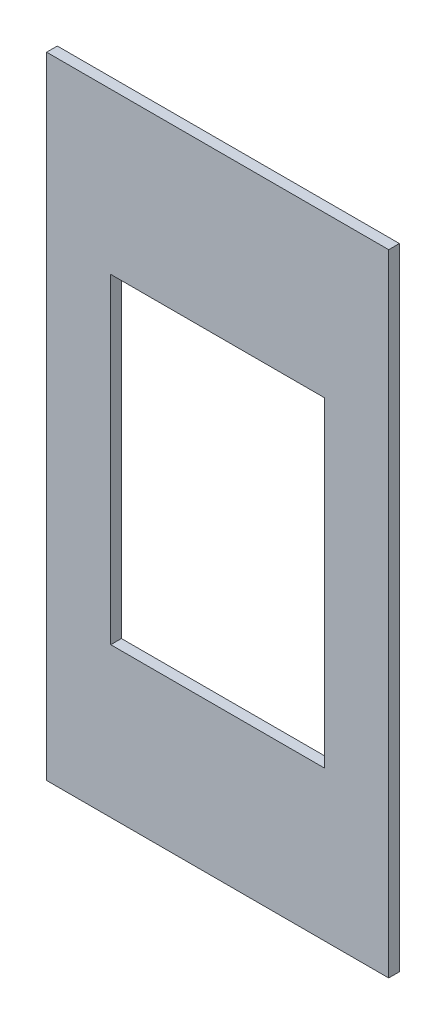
ISO-10303-21;
HEADER;
FILE_DESCRIPTION(('STEP AP214'),'2;1');
FILE_NAME('part.step','',(''),(''),'','','');
FILE_SCHEMA(('AUTOMOTIVE_DESIGN { 1 0 10303 214 1 1 1 1 }'));
ENDSEC;
DATA;
#1=APPLICATION_CONTEXT('core data for automotive mechanical design processes');
#2=APPLICATION_PROTOCOL_DEFINITION('international standard','automotive_design',2000,#1);
#3=PRODUCT_CONTEXT('',#1,'mechanical');
#4=PRODUCT('Part','Part','',(#3));
#5=PRODUCT_RELATED_PRODUCT_CATEGORY('part','',(#4));
#6=PRODUCT_DEFINITION_FORMATION('','',#4);
#7=PRODUCT_DEFINITION_CONTEXT('part definition',#1,'design');
#8=PRODUCT_DEFINITION('design','',#6,#7);
#9=PRODUCT_DEFINITION_SHAPE('','',#8);
#10=(LENGTH_UNIT() NAMED_UNIT(*) SI_UNIT(.MILLI.,.METRE.));
#11=(NAMED_UNIT(*) PLANE_ANGLE_UNIT() SI_UNIT($,.RADIAN.));
#12=(NAMED_UNIT(*) SI_UNIT($,.STERADIAN.) SOLID_ANGLE_UNIT());
#13=UNCERTAINTY_MEASURE_WITH_UNIT(LENGTH_MEASURE(1.E-05),#10,'distance_accuracy_value','');
#14=(GEOMETRIC_REPRESENTATION_CONTEXT(3) GLOBAL_UNCERTAINTY_ASSIGNED_CONTEXT((#13)) GLOBAL_UNIT_ASSIGNED_CONTEXT((#10,
#11,#12)) REPRESENTATION_CONTEXT('',''));
#15=CARTESIAN_POINT('',(0.,0.,0.));
#16=DIRECTION('',(0.,0.,1.));
#17=DIRECTION('',(1.,0.,0.));
#18=AXIS2_PLACEMENT_3D('',#15,#16,#17);
#19=CARTESIAN_POINT('',(-203.2,-374.65,12.7));
#20=DIRECTION('',(0.,0.,1.));
#21=DIRECTION('',(1.,0.,0.));
#22=AXIS2_PLACEMENT_3D('',#19,#20,#21);
#23=PLANE('',#22);
#24=DIRECTION('',(0.,-1.,0.));
#25=VECTOR('',#24,1.);
#26=CARTESIAN_POINT('',(-203.2,374.65,12.7));
#27=LINE('',#26,#25);
#28=CARTESIAN_POINT('',(-203.2,374.65,12.7));
#29=VERTEX_POINT('',#28);
#30=CARTESIAN_POINT('',(-203.2,-374.65,12.7));
#31=VERTEX_POINT('',#30);
#32=EDGE_CURVE('E132',#29,#31,#27,.T.);
#33=ORIENTED_EDGE('',*,*,#32,.T.);
#34=DIRECTION('',(1.,0.,0.));
#35=VECTOR('',#34,1.);
#36=CARTESIAN_POINT('',(-203.2,-374.65,12.7));
#37=LINE('',#36,#35);
#38=CARTESIAN_POINT('',(203.2,-374.65,12.7));
#39=VERTEX_POINT('',#38);
#40=EDGE_CURVE('E135',#31,#39,#37,.T.);
#41=ORIENTED_EDGE('',*,*,#40,.T.);
#42=DIRECTION('',(0.,1.,0.));
#43=VECTOR('',#42,1.);
#44=CARTESIAN_POINT('',(203.2,374.65,12.7));
#45=LINE('',#44,#43);
#46=CARTESIAN_POINT('',(203.2,374.65,12.7));
#47=VERTEX_POINT('',#46);
#48=EDGE_CURVE('E138',#39,#47,#45,.T.);
#49=ORIENTED_EDGE('',*,*,#48,.T.);
#50=DIRECTION('',(-1.,0.,0.));
#51=VECTOR('',#50,1.);
#52=CARTESIAN_POINT('',(-203.2,374.65,12.7));
#53=LINE('',#52,#51);
#54=EDGE_CURVE('E140',#47,#29,#53,.T.);
#55=ORIENTED_EDGE('',*,*,#54,.T.);
#56=EDGE_LOOP('',(#33,#41,#49,#55));
#57=FACE_BOUND('',#56,.T.);
#58=DIRECTION('',(1.,0.,0.));
#59=VECTOR('',#58,1.);
#60=CARTESIAN_POINT('',(-127.,-196.85,12.7));
#61=LINE('',#60,#59);
#62=CARTESIAN_POINT('',(-127.,-196.85,12.7));
#63=VERTEX_POINT('',#62);
#64=CARTESIAN_POINT('',(127.,-196.85,12.7));
#65=VERTEX_POINT('',#64);
#66=EDGE_CURVE('E104',#63,#65,#61,.T.);
#67=ORIENTED_EDGE('',*,*,#66,.F.);
#68=DIRECTION('',(0.,-1.,0.));
#69=VECTOR('',#68,1.);
#70=CARTESIAN_POINT('',(-127.,184.15,12.7));
#71=LINE('',#70,#69);
#72=CARTESIAN_POINT('',(-127.,184.15,12.7));
#73=VERTEX_POINT('',#72);
#74=EDGE_CURVE('E96',#73,#63,#71,.T.);
#75=ORIENTED_EDGE('',*,*,#74,.F.);
#76=DIRECTION('',(-1.,0.,0.));
#77=VECTOR('',#76,1.);
#78=CARTESIAN_POINT('',(-127.,184.15,12.7));
#79=LINE('',#78,#77);
#80=CARTESIAN_POINT('',(127.,184.15,12.7));
#81=VERTEX_POINT('',#80);
#82=EDGE_CURVE('E118',#81,#73,#79,.T.);
#83=ORIENTED_EDGE('',*,*,#82,.F.);
#84=DIRECTION('',(0.,1.,0.));
#85=VECTOR('',#84,1.);
#86=CARTESIAN_POINT('',(127.,184.15,12.7));
#87=LINE('',#86,#85);
#88=EDGE_CURVE('E116',#65,#81,#87,.T.);
#89=ORIENTED_EDGE('',*,*,#88,.F.);
#90=EDGE_LOOP('',(#67,#75,#83,#89));
#91=FACE_BOUND('',#90,.T.);
#92=ADVANCED_FACE('F31',(#57,#91),#23,.T.);
#93=CARTESIAN_POINT('',(-203.2,-374.65,0.));
#94=DIRECTION('',(0.,0.,1.));
#95=DIRECTION('',(1.,0.,0.));
#96=AXIS2_PLACEMENT_3D('',#93,#94,#95);
#97=PLANE('',#96);
#98=DIRECTION('',(0.,-1.,0.));
#99=VECTOR('',#98,1.);
#100=CARTESIAN_POINT('',(-203.2,374.65,0.));
#101=LINE('',#100,#99);
#102=CARTESIAN_POINT('',(-203.2,374.65,0.));
#103=VERTEX_POINT('',#102);
#104=CARTESIAN_POINT('',(-203.2,-374.65,0.));
#105=VERTEX_POINT('',#104);
#106=EDGE_CURVE('E112',#103,#105,#101,.T.);
#107=ORIENTED_EDGE('',*,*,#106,.F.);
#108=DIRECTION('',(-1.,0.,0.));
#109=VECTOR('',#108,1.);
#110=CARTESIAN_POINT('',(-203.2,374.65,0.));
#111=LINE('',#110,#109);
#112=CARTESIAN_POINT('',(203.2,374.65,0.));
#113=VERTEX_POINT('',#112);
#114=EDGE_CURVE('E136',#113,#103,#111,.T.);
#115=ORIENTED_EDGE('',*,*,#114,.F.);
#116=DIRECTION('',(0.,1.,0.));
#117=VECTOR('',#116,1.);
#118=CARTESIAN_POINT('',(203.2,374.65,0.));
#119=LINE('',#118,#117);
#120=CARTESIAN_POINT('',(203.2,-374.65,0.));
#121=VERTEX_POINT('',#120);
#122=EDGE_CURVE('E147',#121,#113,#119,.T.);
#123=ORIENTED_EDGE('',*,*,#122,.F.);
#124=DIRECTION('',(1.,0.,0.));
#125=VECTOR('',#124,1.);
#126=CARTESIAN_POINT('',(-203.2,-374.65,0.));
#127=LINE('',#126,#125);
#128=EDGE_CURVE('E145',#105,#121,#127,.T.);
#129=ORIENTED_EDGE('',*,*,#128,.F.);
#130=EDGE_LOOP('',(#107,#115,#123,#129));
#131=FACE_BOUND('',#130,.T.);
#132=DIRECTION('',(0.,-1.,0.));
#133=VECTOR('',#132,1.);
#134=CARTESIAN_POINT('',(-127.,184.15,0.));
#135=LINE('',#134,#133);
#136=CARTESIAN_POINT('',(-127.,184.15,0.));
#137=VERTEX_POINT('',#136);
#138=CARTESIAN_POINT('',(-127.,-196.85,0.));
#139=VERTEX_POINT('',#138);
#140=EDGE_CURVE('E54',#137,#139,#135,.T.);
#141=ORIENTED_EDGE('',*,*,#140,.T.);
#142=DIRECTION('',(1.,0.,0.));
#143=VECTOR('',#142,1.);
#144=CARTESIAN_POINT('',(-127.,-196.85,0.));
#145=LINE('',#144,#143);
#146=CARTESIAN_POINT('',(127.,-196.85,0.));
#147=VERTEX_POINT('',#146);
#148=EDGE_CURVE('E111',#139,#147,#145,.T.);
#149=ORIENTED_EDGE('',*,*,#148,.T.);
#150=DIRECTION('',(0.,1.,0.));
#151=VECTOR('',#150,1.);
#152=CARTESIAN_POINT('',(127.,184.15,0.));
#153=LINE('',#152,#151);
#154=CARTESIAN_POINT('',(127.,184.15,0.));
#155=VERTEX_POINT('',#154);
#156=EDGE_CURVE('E124',#147,#155,#153,.T.);
#157=ORIENTED_EDGE('',*,*,#156,.T.);
#158=DIRECTION('',(-1.,0.,0.));
#159=VECTOR('',#158,1.);
#160=CARTESIAN_POINT('',(-127.,184.15,0.));
#161=LINE('',#160,#159);
#162=EDGE_CURVE('E105',#155,#137,#161,.T.);
#163=ORIENTED_EDGE('',*,*,#162,.T.);
#164=EDGE_LOOP('',(#141,#149,#157,#163));
#165=FACE_BOUND('',#164,.T.);
#166=ADVANCED_FACE('F165',(#131,#165),#97,.F.);
#167=CARTESIAN_POINT('',(-203.2,374.65,12.7));
#168=DIRECTION('',(1.,0.,0.));
#169=DIRECTION('',(0.,1.,0.));
#170=AXIS2_PLACEMENT_3D('',#167,#168,#169);
#171=PLANE('',#170);
#172=ORIENTED_EDGE('',*,*,#106,.T.);
#173=DIRECTION('',(0.,0.,-1.));
#174=VECTOR('',#173,1.);
#175=CARTESIAN_POINT('',(-203.2,-374.65,12.7));
#176=LINE('',#175,#174);
#177=EDGE_CURVE('E11',#31,#105,#176,.T.);
#178=ORIENTED_EDGE('',*,*,#177,.F.);
#179=ORIENTED_EDGE('',*,*,#32,.F.);
#180=DIRECTION('',(0.,0.,-1.));
#181=VECTOR('',#180,1.);
#182=CARTESIAN_POINT('',(-203.2,374.65,12.7));
#183=LINE('',#182,#181);
#184=EDGE_CURVE('E142',#29,#103,#183,.T.);
#185=ORIENTED_EDGE('',*,*,#184,.T.);
#186=EDGE_LOOP('',(#172,#178,#179,#185));
#187=FACE_BOUND('',#186,.T.);
#188=ADVANCED_FACE('F33',(#187),#171,.F.);
#189=CARTESIAN_POINT('',(-203.2,-374.65,12.7));
#190=DIRECTION('',(0.,1.,0.));
#191=DIRECTION('',(0.,0.,1.));
#192=AXIS2_PLACEMENT_3D('',#189,#190,#191);
#193=PLANE('',#192);
#194=ORIENTED_EDGE('',*,*,#128,.T.);
#195=DIRECTION('',(0.,0.,-1.));
#196=VECTOR('',#195,1.);
#197=CARTESIAN_POINT('',(203.2,-374.65,12.7));
#198=LINE('',#197,#196);
#199=EDGE_CURVE('E39',#39,#121,#198,.T.);
#200=ORIENTED_EDGE('',*,*,#199,.F.);
#201=ORIENTED_EDGE('',*,*,#40,.F.);
#202=ORIENTED_EDGE('',*,*,#177,.T.);
#203=EDGE_LOOP('',(#194,#200,#201,#202));
#204=FACE_BOUND('',#203,.T.);
#205=ADVANCED_FACE('F175',(#204),#193,.F.);
#206=CARTESIAN_POINT('',(203.2,374.65,12.7));
#207=DIRECTION('',(-1.,0.,0.));
#208=DIRECTION('',(0.,-1.,0.));
#209=AXIS2_PLACEMENT_3D('',#206,#207,#208);
#210=PLANE('',#209);
#211=ORIENTED_EDGE('',*,*,#122,.T.);
#212=DIRECTION('',(0.,0.,-1.));
#213=VECTOR('',#212,1.);
#214=CARTESIAN_POINT('',(203.2,374.65,12.7));
#215=LINE('',#214,#213);
#216=EDGE_CURVE('E152',#47,#113,#215,.T.);
#217=ORIENTED_EDGE('',*,*,#216,.F.);
#218=ORIENTED_EDGE('',*,*,#48,.F.);
#219=ORIENTED_EDGE('',*,*,#199,.T.);
#220=EDGE_LOOP('',(#211,#217,#218,#219));
#221=FACE_BOUND('',#220,.T.);
#222=ADVANCED_FACE('F159',(#221),#210,.F.);
#223=CARTESIAN_POINT('',(-203.2,374.65,12.7));
#224=DIRECTION('',(0.,-1.,0.));
#225=DIRECTION('',(0.,0.,-1.));
#226=AXIS2_PLACEMENT_3D('',#223,#224,#225);
#227=PLANE('',#226);
#228=ORIENTED_EDGE('',*,*,#114,.T.);
#229=ORIENTED_EDGE('',*,*,#184,.F.);
#230=ORIENTED_EDGE('',*,*,#54,.F.);
#231=ORIENTED_EDGE('',*,*,#216,.T.);
#232=EDGE_LOOP('',(#228,#229,#230,#231));
#233=FACE_BOUND('',#232,.T.);
#234=ADVANCED_FACE('F169',(#233),#227,.F.);
#235=CARTESIAN_POINT('',(-127.,184.15,12.7));
#236=DIRECTION('',(1.,0.,0.));
#237=DIRECTION('',(0.,1.,0.));
#238=AXIS2_PLACEMENT_3D('',#235,#236,#237);
#239=PLANE('',#238);
#240=ORIENTED_EDGE('',*,*,#140,.F.);
#241=DIRECTION('',(0.,0.,-1.));
#242=VECTOR('',#241,1.);
#243=CARTESIAN_POINT('',(-127.,184.15,12.7));
#244=LINE('',#243,#242);
#245=EDGE_CURVE('E100',#73,#137,#244,.T.);
#246=ORIENTED_EDGE('',*,*,#245,.F.);
#247=ORIENTED_EDGE('',*,*,#74,.T.);
#248=DIRECTION('',(0.,0.,-1.));
#249=VECTOR('',#248,1.);
#250=CARTESIAN_POINT('',(-127.,-196.85,12.7));
#251=LINE('',#250,#249);
#252=EDGE_CURVE('E99',#63,#139,#251,.T.);
#253=ORIENTED_EDGE('',*,*,#252,.T.);
#254=EDGE_LOOP('',(#240,#246,#247,#253));
#255=FACE_BOUND('',#254,.T.);
#256=ADVANCED_FACE('F98',(#255),#239,.T.);
#257=CARTESIAN_POINT('',(-127.,-196.85,12.7));
#258=DIRECTION('',(0.,1.,0.));
#259=DIRECTION('',(0.,0.,1.));
#260=AXIS2_PLACEMENT_3D('',#257,#258,#259);
#261=PLANE('',#260);
#262=ORIENTED_EDGE('',*,*,#148,.F.);
#263=ORIENTED_EDGE('',*,*,#252,.F.);
#264=ORIENTED_EDGE('',*,*,#66,.T.);
#265=DIRECTION('',(0.,0.,-1.));
#266=VECTOR('',#265,1.);
#267=CARTESIAN_POINT('',(127.,-196.85,12.7));
#268=LINE('',#267,#266);
#269=EDGE_CURVE('E113',#65,#147,#268,.T.);
#270=ORIENTED_EDGE('',*,*,#269,.T.);
#271=EDGE_LOOP('',(#262,#263,#264,#270));
#272=FACE_BOUND('',#271,.T.);
#273=ADVANCED_FACE('F108',(#272),#261,.T.);
#274=CARTESIAN_POINT('',(127.,184.15,12.7));
#275=DIRECTION('',(-1.,0.,0.));
#276=DIRECTION('',(0.,-1.,0.));
#277=AXIS2_PLACEMENT_3D('',#274,#275,#276);
#278=PLANE('',#277);
#279=ORIENTED_EDGE('',*,*,#156,.F.);
#280=ORIENTED_EDGE('',*,*,#269,.F.);
#281=ORIENTED_EDGE('',*,*,#88,.T.);
#282=DIRECTION('',(0.,0.,-1.));
#283=VECTOR('',#282,1.);
#284=CARTESIAN_POINT('',(127.,184.15,12.7));
#285=LINE('',#284,#283);
#286=EDGE_CURVE('E46',#81,#155,#285,.T.);
#287=ORIENTED_EDGE('',*,*,#286,.T.);
#288=EDGE_LOOP('',(#279,#280,#281,#287));
#289=FACE_BOUND('',#288,.T.);
#290=ADVANCED_FACE('F198',(#289),#278,.T.);
#291=CARTESIAN_POINT('',(-127.,184.15,12.7));
#292=DIRECTION('',(0.,-1.,0.));
#293=DIRECTION('',(0.,0.,-1.));
#294=AXIS2_PLACEMENT_3D('',#291,#292,#293);
#295=PLANE('',#294);
#296=ORIENTED_EDGE('',*,*,#162,.F.);
#297=ORIENTED_EDGE('',*,*,#286,.F.);
#298=ORIENTED_EDGE('',*,*,#82,.T.);
#299=ORIENTED_EDGE('',*,*,#245,.T.);
#300=EDGE_LOOP('',(#296,#297,#298,#299));
#301=FACE_BOUND('',#300,.T.);
#302=ADVANCED_FACE('F202',(#301),#295,.T.);
#303=CLOSED_SHELL('',(#92,#166,#188,#205,#222,#234,#256,#273,#290,#302));
#304=MANIFOLD_SOLID_BREP('B2',#303);
#305=ADVANCED_BREP_SHAPE_REPRESENTATION('',(#18,#304),#14);
#306=SHAPE_DEFINITION_REPRESENTATION(#9,#305);
ENDSEC;
END-ISO-10303-21;
